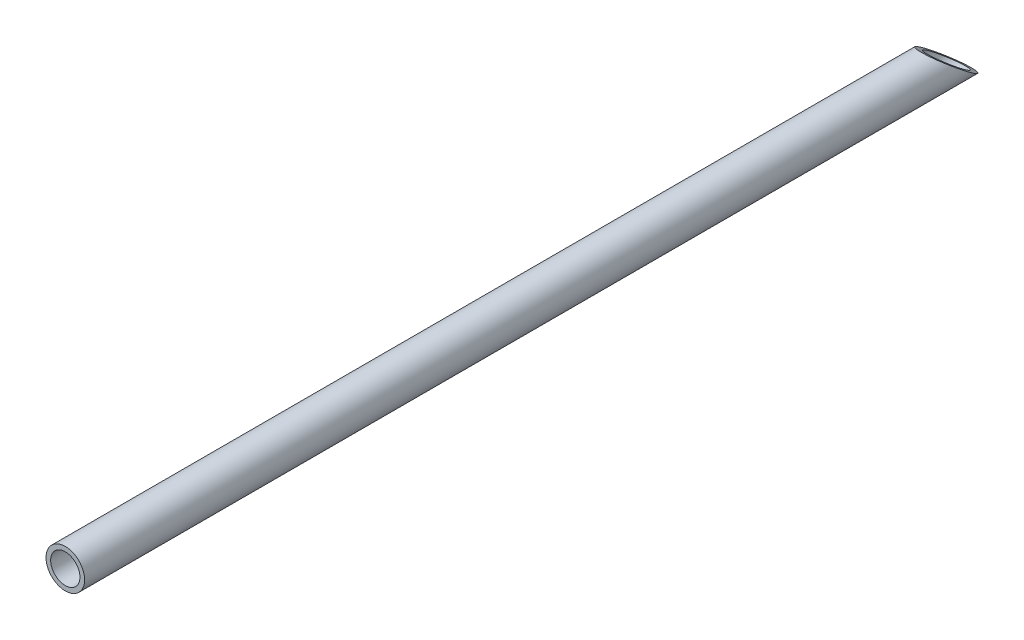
ISO-10303-21;
HEADER;
FILE_DESCRIPTION(('STEP AP214'),'2;1');
FILE_NAME('part.step','',(''),(''),'','','');
FILE_SCHEMA(('AUTOMOTIVE_DESIGN { 1 0 10303 214 1 1 1 1 }'));
ENDSEC;
DATA;
#1=APPLICATION_CONTEXT('core data for automotive mechanical design processes');
#2=APPLICATION_PROTOCOL_DEFINITION('international standard','automotive_design',2000,#1);
#3=PRODUCT_CONTEXT('',#1,'mechanical');
#4=PRODUCT('Part','Part','',(#3));
#5=PRODUCT_RELATED_PRODUCT_CATEGORY('part','',(#4));
#6=PRODUCT_DEFINITION_FORMATION('','',#4);
#7=PRODUCT_DEFINITION_CONTEXT('part definition',#1,'design');
#8=PRODUCT_DEFINITION('design','',#6,#7);
#9=PRODUCT_DEFINITION_SHAPE('','',#8);
#10=(LENGTH_UNIT() NAMED_UNIT(*) SI_UNIT(.MILLI.,.METRE.));
#11=(NAMED_UNIT(*) PLANE_ANGLE_UNIT() SI_UNIT($,.RADIAN.));
#12=(NAMED_UNIT(*) SI_UNIT($,.STERADIAN.) SOLID_ANGLE_UNIT());
#13=UNCERTAINTY_MEASURE_WITH_UNIT(LENGTH_MEASURE(1.E-05),#10,'distance_accuracy_value','');
#14=(GEOMETRIC_REPRESENTATION_CONTEXT(3) GLOBAL_UNCERTAINTY_ASSIGNED_CONTEXT((#13)) GLOBAL_UNIT_ASSIGNED_CONTEXT((#10,
#11,#12)) REPRESENTATION_CONTEXT('',''));
#15=CARTESIAN_POINT('',(0.,0.,0.));
#16=DIRECTION('',(0.,0.,1.));
#17=DIRECTION('',(1.,0.,0.));
#18=AXIS2_PLACEMENT_3D('',#15,#16,#17);
#19=CARTESIAN_POINT('',(0.,0.,0.));
#20=DIRECTION('',(0.,0.,1.));
#21=DIRECTION('',(1.,0.,0.));
#22=AXIS2_PLACEMENT_3D('',#19,#20,#21);
#23=CYLINDRICAL_SURFACE('',#22,1.0541);
#24=CARTESIAN_POINT('',(0.,0.,49.5));
#25=DIRECTION('',(0.,0.,1.));
#26=DIRECTION('',(1.,0.,0.));
#27=AXIS2_PLACEMENT_3D('',#24,#25,#26);
#28=CIRCLE('',#27,1.0541);
#29=CARTESIAN_POINT('',(-1.0541,0.,49.5));
#30=VERTEX_POINT('',#29);
#31=EDGE_CURVE('E52',#30,#30,#28,.T.);
#32=ORIENTED_EDGE('',*,*,#31,.F.);
#33=DIRECTION('',(0.,0.,-1.));
#34=VECTOR('',#33,1.);
#35=CARTESIAN_POINT('',(-1.0541,0.,0.));
#36=LINE('',#35,#34);
#37=CARTESIAN_POINT('',(-1.0541,0.,1.37372986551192));
#38=VERTEX_POINT('',#37);
#39=EDGE_CURVE('E11',#30,#38,#36,.T.);
#40=ORIENTED_EDGE('',*,*,#39,.T.);
#41=CARTESIAN_POINT('',(0.,0.,1.37372986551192));
#42=DIRECTION('',(0.,-0.793353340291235,0.608761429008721));
#43=DIRECTION('',(0.,0.608761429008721,0.793353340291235));
#44=AXIS2_PLACEMENT_3D('',#41,#42,#43);
#45=ELLIPSE('',#44,1.7315485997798,1.0541);
#46=EDGE_CURVE('E50',#38,#38,#45,.T.);
#47=ORIENTED_EDGE('',*,*,#46,.T.);
#48=ORIENTED_EDGE('',*,*,#39,.F.);
#49=EDGE_LOOP('',(#32,#40,#47,#48));
#50=FACE_BOUND('',#49,.T.);
#51=ADVANCED_FACE('F16',(#50),#23,.T.);
#52=CARTESIAN_POINT('',(0.,0.,0.));
#53=DIRECTION('',(0.,0.,1.));
#54=DIRECTION('',(1.,0.,0.));
#55=AXIS2_PLACEMENT_3D('',#52,#53,#54);
#56=CYLINDRICAL_SURFACE('',#55,0.8001);
#57=CARTESIAN_POINT('',(0.,0.,49.5));
#58=DIRECTION('',(0.,0.,-1.));
#59=DIRECTION('',(1.,0.,0.));
#60=AXIS2_PLACEMENT_3D('',#57,#58,#59);
#61=CIRCLE('',#60,0.8001);
#62=CARTESIAN_POINT('',(-0.8001,0.,49.5));
#63=VERTEX_POINT('',#62);
#64=EDGE_CURVE('E56',#63,#63,#61,.T.);
#65=ORIENTED_EDGE('',*,*,#64,.F.);
#66=DIRECTION('',(0.,0.,-1.));
#67=VECTOR('',#66,1.);
#68=CARTESIAN_POINT('',(-0.8001,0.,0.));
#69=LINE('',#68,#67);
#70=CARTESIAN_POINT('',(-0.8001,0.,1.37372986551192));
#71=VERTEX_POINT('',#70);
#72=EDGE_CURVE('E25',#63,#71,#69,.T.);
#73=ORIENTED_EDGE('',*,*,#72,.T.);
#74=CARTESIAN_POINT('',(0.,0.,1.37372986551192));
#75=DIRECTION('',(0.,0.793353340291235,-0.60876142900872));
#76=DIRECTION('',(0.,0.60876142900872,0.793353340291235));
#77=AXIS2_PLACEMENT_3D('',#74,#75,#76);
#78=ELLIPSE('',#77,1.31430797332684,0.8001);
#79=EDGE_CURVE('E57',#71,#71,#78,.T.);
#80=ORIENTED_EDGE('',*,*,#79,.T.);
#81=ORIENTED_EDGE('',*,*,#72,.F.);
#82=EDGE_LOOP('',(#65,#73,#80,#81));
#83=FACE_BOUND('',#82,.T.);
#84=ADVANCED_FACE('F85',(#83),#56,.F.);
#85=CARTESIAN_POINT('',(0.,0.,49.5));
#86=DIRECTION('',(0.,0.,1.));
#87=DIRECTION('',(1.,0.,0.));
#88=AXIS2_PLACEMENT_3D('',#85,#86,#87);
#89=PLANE('',#88);
#90=ORIENTED_EDGE('',*,*,#64,.T.);
#91=EDGE_LOOP('',(#90));
#92=FACE_BOUND('',#91,.T.);
#93=ORIENTED_EDGE('',*,*,#31,.T.);
#94=EDGE_LOOP('',(#93));
#95=FACE_BOUND('',#94,.T.);
#96=ADVANCED_FACE('F54',(#92,#95),#89,.T.);
#97=CARTESIAN_POINT('',(0.,1.0541,2.74745973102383));
#98=DIRECTION('',(0.,-0.793353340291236,0.60876142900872));
#99=DIRECTION('',(-1.,0.,0.));
#100=AXIS2_PLACEMENT_3D('',#97,#98,#99);
#101=PLANE('',#100);
#102=ORIENTED_EDGE('',*,*,#79,.F.);
#103=EDGE_LOOP('',(#102));
#104=FACE_BOUND('',#103,.T.);
#105=ORIENTED_EDGE('',*,*,#46,.F.);
#106=EDGE_LOOP('',(#105));
#107=FACE_BOUND('',#106,.T.);
#108=ADVANCED_FACE('F72',(#104,#107),#101,.F.);
#109=CLOSED_SHELL('',(#51,#84,#96,#108));
#110=MANIFOLD_SOLID_BREP('B1',#109);
#111=ADVANCED_BREP_SHAPE_REPRESENTATION('',(#18,#110),#14);
#112=SHAPE_DEFINITION_REPRESENTATION(#9,#111);
ENDSEC;
END-ISO-10303-21;
